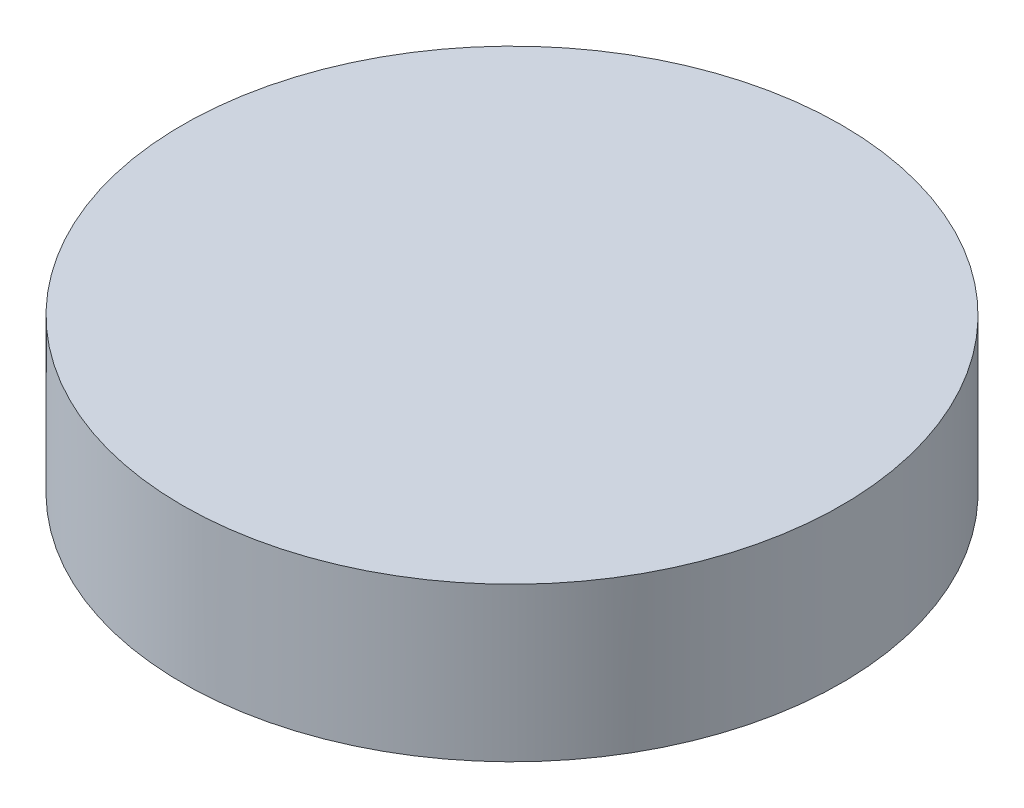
from build123d import *

# Parameters (mm, degrees)
SKETCH1_R           = 15
BOSS_EXTRUDE1_DEPTH = 5
BOSS_EXTRUDE2_START = 2
SKETCH5_R           = 15
SKETCH5_R_2         = 13
SKETCH5_R_3         = 0.805336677
SKETCH5_R_4         = 0.640825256
BOSS_EXTRUDE2_DEPTH = 2
BOSS_EXTRUDE3_DEPTH = 2


with BuildPart() as part:
    # Sketch1 → Boss-Extrude1 (new body)
    with BuildSketch(Plane(origin=(0, 0, 0), x_dir=(1, 0, 0), z_dir=(0, 1, 0))):
        with Locations(Location((0, 0, 0), (0, 0, 270))):
            Circle(SKETCH1_R)
    extrude(amount=BOSS_EXTRUDE1_DEPTH)

    # Sketch5 → Boss-Extrude2 (add)
    # profile 1 of 6: a face of its own
    with BuildSketch(Plane.XZ.offset(BOSS_EXTRUDE2_START)):
        with Locations(Location((0, 0, 0), (0, 0, 270))):
            Circle(SKETCH5_R)
        with Locations(Location((0, 0, 0), (0, 0, 270))):
            Circle(SKETCH5_R_2, mode=Mode.SUBTRACT)
    # profile 2 of 6: a face of its own
    with BuildSketch(Plane.XZ.offset(BOSS_EXTRUDE2_START)):
        with BuildLine():
            ThreePointArc((6.197066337, -6.616619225), (6.703380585, -6.246578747), (6.333340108, -5.740264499))
            Line((6.333340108, -5.740264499), (-7.136846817, -3.645641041))
            ThreePointArc((-7.136846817, -3.645641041), (-7.643161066, -4.015681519), (-7.273120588, -4.521995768))
            Line((-7.273120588, -4.521995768), (6.197066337, -6.616619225))
        make_face()
    # profile 3 of 6: a face of its own
    with BuildSketch(Plane.XZ.offset(BOSS_EXTRUDE2_START)):
        with BuildLine():
            Line((1.921350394, -4.083818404), (4.226253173, -2.278945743))
            Line((4.226253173, -2.278945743), (4.676391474, -3.447725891))
            ThreePointArc((4.676391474, -3.447725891), (5.187318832, -3.674527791), (5.414120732, -3.163600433))
            Line((5.414120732, -3.163600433), (4.877118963, -1.769280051))
            Line((4.877118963, -1.769280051), (8.650736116, 1.185681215))
            ThreePointArc((8.650736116, 1.185681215), (8.733798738, 1.868377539), (8.051102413, 1.951440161))
            Line((8.051102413, 1.951440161), (4.511594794, -0.820199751))
            Line((4.511594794, -0.820199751), (3.854509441, 0.885916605))
            ThreePointArc((3.854509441, 0.885916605), (4.917607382, 1.885265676), (5.119030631, 3.330362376))
            ThreePointArc((5.119030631, 3.330362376), (4.586474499, 3.683084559), (4.233752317, 3.150528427))
            ThreePointArc((4.233752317, 3.150528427), (4.125058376, 2.319690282), (3.529204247, 1.730568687))
            Line((3.529204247, 1.730568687), (3.170992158, 2.660663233))
            ThreePointArc((3.170992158, 2.660663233), (2.6600648, 2.887465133), (2.433262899, 2.376537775))
            Line((2.433262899, 2.376537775), (3.860729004, -1.329865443))
            Line((3.860729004, -1.329865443), (1.321716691, -3.318059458))
            ThreePointArc((1.321716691, -3.318059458), (1.238654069, -4.000755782), (1.921350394, -4.083818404))
        make_face()
    # profile 4 of 6: a face of its own
    with BuildSketch(Plane.XZ.offset(BOSS_EXTRUDE2_START)):
        with BuildLine():
            Line((-0.875721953, -1.166670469), (-0.721055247, -0.228003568))
            Line((-0.721055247, -0.228003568), (0.4885883, -0.427319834))
            ThreePointArc((0.4885883, -0.427319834), (0.986318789, -0.070410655), (0.629409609, 0.427319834))
            Line((0.629409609, 0.427319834), (-0.580233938, 0.626636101))
            Line((-0.580233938, 0.626636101), (-0.53216555, 0.918361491))
            ThreePointArc((-0.53216555, 0.918361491), (-0.935547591, 1.480901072), (-1.498087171, 1.077519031))
            Line((-1.498087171, 1.077519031), (-1.546155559, 0.785793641))
            Line((-1.546155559, 0.785793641), (-2.369733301, 0.921496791))
            add(Edge.make_bspline(
                [(-2.369733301, 0.921496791), (-2.377261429, 1.017453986), (-2.436559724, 1.508344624), (-2.651397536, 2.213498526), (-3.071767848, 3.030069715), (-3.515777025, 3.423670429), (-4.027697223, 3.473710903), (-4.490678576, 3.344985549), (-5.009636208, 2.994804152), (-5.364096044, 2.317409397), (-5.351765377, 1.780167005), (-5.324172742, 1.49650236), (-5.313820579, 1.406602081)],
                knots=[0.359768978, 0.359768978, 0.359768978, 0.359768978, 0.375, 0.4375, 0.46875, 0.5, 0.515625, 0.53125, 0.5625, 0.59375, 0.625, 0.640107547, 0.640107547, 0.640107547, 0.640107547], degree=3))
            Line((-5.313820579, 1.406602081), (-6.296741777, 1.568560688))
            ThreePointArc((-6.296741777, 1.568560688), (-6.794472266, 1.211651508), (-6.437563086, 0.713921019))
            Line((-6.437563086, 0.713921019), (-5.187578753, 0.507957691))
            add(Edge.make_bspline(
                [(-5.187578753, 0.507957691), (-5.147341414, 0.193740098), (-5.122576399, -0.122293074), (-5.136979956, -0.464531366)],
                knots=[0.693045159, 0.693045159, 0.693045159, 0.693045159, 0.749635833, 0.749635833, 0.749635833, 0.749635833], degree=3))
            Line((-5.136979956, -0.464531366), (-6.847685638, -0.182653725))
            ThreePointArc((-6.847685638, -0.182653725), (-7.345416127, -0.539562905), (-6.988506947, -1.037293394))
            Line((-6.988506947, -1.037293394), (-5.249040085, -1.323910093))
            add(Edge.make_bspline(
                [(-5.249040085, -1.323910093), (-5.271173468, -1.424056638), (-5.343954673, -1.707265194), (-5.504797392, -2.123214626), (-5.747498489, -2.482279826), (-5.99677095, -2.651736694), (-6.243898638, -2.683504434), (-6.580111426, -2.549595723), (-6.912164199, -2.289270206), (-7.115417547, -2.08102016), (-7.204983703, -1.979766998)],
                knots=[0.795978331, 0.795978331, 0.795978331, 0.795978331, 0.8125, 0.84375, 0.875, 0.90625, 0.9375, 0.96875, 0.984375, 1, 1, 1, 1], degree=3))
            ThreePointArc((-7.204983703, -1.979766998), (-7.628454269, -1.953830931), (-7.654390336, -2.377301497))
            add(Edge.make_bspline(
                [(-4.656359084, -1.421567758), (-4.683160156, -1.545818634), (-4.821904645, -2.093050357), (-5.1308256, -2.765237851), (-5.753598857, -3.236562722), (-6.375615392, -3.299736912), (-6.900944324, -3.062695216), (-7.320072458, -2.731189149), (-7.550482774, -2.494767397), (-7.654390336, -2.377301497)],
                knots=[0.794442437, 0.794442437, 0.794442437, 0.794442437, 0.8125, 0.875, 0.90625, 0.9375, 0.96875, 0.984375, 1, 1, 1, 1], degree=3))
            Line((-4.656359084, -1.421567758), (-3.887641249, -1.548231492))
            add(Edge.make_bspline(
                [(-1.723356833, -3.420796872), (-1.800278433, -3.471376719), (-2.098637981, -3.615537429), (-2.675605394, -3.680931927), (-3.38657736, -3.534960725), (-3.998248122, -3.214544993), (-4.283801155, -2.566329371), (-4.129240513, -2.021235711), (-3.965224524, -1.689891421), (-3.887641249, -1.548231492)],
                knots=[0.01945361, 0.01945361, 0.01945361, 0.01945361, 0.03125, 0.0625, 0.09375, 0.125, 0.15625, 0.1875, 0.211021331, 0.211021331, 0.211021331, 0.211021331], degree=3))
            ThreePointArc((-1.723356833, -3.420796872), (-1.370034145, -3.32702374), (-1.180213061, -3.014616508))
            Line((-1.180213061, -3.014616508), (-1.016543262, -2.021310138))
            Line((-1.016543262, -2.021310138), (-0.06235556, -2.178534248))
            ThreePointArc((-0.06235556, -2.178534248), (0.435374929, -1.821625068), (0.078465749, -1.323894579))
            Line((0.078465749, -1.323894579), (-0.875721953, -1.166670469))
        make_face()
        with BuildLine():
            Line((-3.412894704, -0.748613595), (-4.540965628, -0.562738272))
            add(Edge.make_bspline(
                [(-4.571959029, 0.40652035), (-4.541833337, 0.122351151), (-4.52347794, -0.200698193), (-4.53980986, -0.541385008), (-4.540965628, -0.562738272)],
                knots=[0.703071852, 0.703071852, 0.703071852, 0.703071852, 0.75, 0.753128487, 0.753128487, 0.753128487, 0.753128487], degree=3))
            Line((-4.571959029, 0.40652035), (-3.019796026, 0.150766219))
            add(Edge.make_bspline(
                [(-3.412894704, -0.748613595), (-3.326522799, -0.600753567), (-3.15395044, -0.285273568), (-3.056218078, -0.001558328), (-3.019796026, 0.150766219)],
                knots=[0.255756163, 0.255756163, 0.255756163, 0.255756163, 0.28125, 0.311624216, 0.311624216, 0.311624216, 0.311624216], degree=3))
        make_face(mode=Mode.SUBTRACT)
        with BuildLine():
            Line((-3.256316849, -1.652256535), (-1.982464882, -1.862152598))
            Line((-1.982464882, -1.862152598), (-2.146134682, -2.855458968))
            ThreePointArc((-2.146134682, -2.855458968), (-2.152158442, -2.913174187), (-2.151309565, -2.971196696))
            add(Edge.make_bspline(
                [(-2.151309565, -2.971196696), (-2.159595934, -2.974382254), (-2.28833046, -3.0212003), (-2.640678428, -3.074543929), (-3.193624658, -2.964789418), (-3.573162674, -2.718925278), (-3.628009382, -2.57690179), (-3.569540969, -2.218966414), (-3.38271577, -1.867713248), (-3.267690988, -1.671522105), (-3.256316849, -1.652256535)],
                knots=[0.029037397, 0.029037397, 0.029037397, 0.029037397, 0.03125, 0.0625, 0.09375, 0.125, 0.15625, 0.1875, 0.21875, 0.222132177, 0.222132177, 0.222132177, 0.222132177], degree=3))
        make_face(mode=Mode.SUBTRACT)
        with BuildLine():
            Line((-2.426587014, 0.053021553), (-1.686976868, -0.068846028))
            Line((-1.686976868, -0.068846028), (-1.841643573, -1.007512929))
            Line((-1.841643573, -1.007512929), (-2.782165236, -0.852540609))
            add(Edge.make_bspline(
                [(-2.782165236, -0.852540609), (-2.731173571, -0.759105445), (-2.581580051, -0.466902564), (-2.475607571, -0.162241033), (-2.428461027, 0.04461869), (-2.426587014, 0.053021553)],
                knots=[0.266365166, 0.266365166, 0.266365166, 0.266365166, 0.28125, 0.3125, 0.313823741, 0.313823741, 0.313823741, 0.313823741], degree=3))
        make_face(mode=Mode.SUBTRACT)
        with BuildLine():
            add(Edge.make_bspline(
                [(-2.982354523, 1.022440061), (-2.986422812, 1.052186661), (-3.015924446, 1.245586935), (-3.107846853, 1.617386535), (-3.309555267, 2.192409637), (-3.580399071, 2.685218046), (-3.801540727, 2.8478461), (-3.954389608, 2.86295541), (-4.209113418, 2.805153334), (-4.564466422, 2.552093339), (-4.747926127, 2.206135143), (-4.753435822, 1.764277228), (-4.716026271, 1.447487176), (-4.696371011, 1.304863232)],
                knots=[0.369281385, 0.369281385, 0.369281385, 0.369281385, 0.375, 0.40625, 0.4375, 0.46875, 0.5, 0.515625, 0.53125, 0.5625, 0.59375, 0.625, 0.650566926, 0.650566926, 0.650566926, 0.650566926], degree=3))
            Line((-2.982354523, 1.022440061), (-4.696371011, 1.304863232))
        make_face(mode=Mode.SUBTRACT)
    # profile 5 of 6: a face of its own
    with BuildSketch(Plane.XZ.offset(BOSS_EXTRUDE2_START)):
        with Locations(Location((-0.660948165, 2.518600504, 0), (0, 0, 90))):
            Circle(SKETCH5_R_3)
    # profile 6 of 6: a face of its own
    with BuildSketch(Plane.XZ.offset(BOSS_EXTRUDE2_START)):
        with Locations(Location((6.265203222, 2.180621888, 0), (0, 0, 90))):
            Circle(SKETCH5_R_4)
    extrude(amount=-BOSS_EXTRUDE2_DEPTH)

    # Sketch6 → Boss-Extrude3 (add)
    # profile 1 of 25: a face of its own
    with BuildSketch(Plane.XZ):
        Polygon((2.668028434, -9.114387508), (2.039711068, -9.201219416), (0.875112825, -11.676253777), (0.560340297, -9.406620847), (-0.095725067, -9.498395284), (0.383166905, -12.947209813), (1.013317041, -12.859130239), (2.176452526, -10.391796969), (2.490664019, -12.654301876), (3.146920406, -12.563202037), align=None)
    # profile 2 of 25: a face of its own
    with BuildSketch(Plane.XZ):
        Polygon((4.171757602, -8.526991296), (2.394637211, -9.206261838), (2.626056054, -9.812981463), (3.787794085, -9.369116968), (4.01275105, -9.958098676), (2.851013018, -10.401963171), (3.078609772, -10.997050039), (4.240347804, -10.553185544), (4.567650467, -11.409033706), (3.405912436, -11.852898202), (3.638211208, -12.461652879), (5.415331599, -11.782382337), align=None)
    # profile 3 of 25: a face of its own
    with BuildSketch(Plane.XZ):
        Polygon((5.676062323, -7.6185237), (4.058675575, -8.613060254), (4.398053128, -9.165092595), (5.456165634, -8.514906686), (5.785298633, -9.049944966), (4.727186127, -9.700130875), (5.060667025, -10.242093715), (6.118779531, -9.591907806), (6.597886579, -10.370546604), (5.539774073, -11.020732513), (5.880392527, -11.574967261), (7.497779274, -10.580430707), align=None)
    # profile 4 of 25: a face of its own
    with BuildSketch(Plane.XZ):
        Polygon((7.731357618, -5.424538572), (7.28273248, -5.892976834), (8.481795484, -8.15371348), (6.16187011, -7.064042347), (5.719978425, -7.525874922), (7.829993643, -10.358654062), (8.271885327, -9.896821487), (6.941474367, -8.106309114), (9.042872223, -9.091696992), (9.447165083, -8.669377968), (8.364558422, -6.619775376), (10.216781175, -7.865014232), (10.663365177, -7.398067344), align=None)
    # profile 5 of 25: a face of its own
    with BuildSketch(Plane.XZ):
        Polygon((8.560917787, -3.927979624), (8.260207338, -4.525018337), (10.75494135, -7.272120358), (11.062875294, -6.660112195), (10.547583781, -6.097852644), (11.182563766, -4.836067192), (11.946747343, -4.904385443), (12.254681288, -4.29237728), align=None)
        Polygon((9.229021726, -4.643119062), (10.498317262, -4.766029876), (10.08420501, -5.58786652), align=None, mode=Mode.SUBTRACT)
    # profile 6 of 25: a face of its own
    with BuildSketch(Plane.XZ):
        Polygon((9.512339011, -0.743014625), (9.357826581, -1.435119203), (10.431807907, -2.337383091), (9.077135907, -2.69163212), (8.924602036, -3.37459421), (11.064141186, -2.814794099), (12.52940119, -3.142596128), (12.674580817, -2.493367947), (11.209320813, -2.165565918), align=None)
    # profile 7 of 25: a face of its own
    with BuildSketch(Plane.XZ):
        Polygon((9.163097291, 2.522817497), (9.240000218, 1.894585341), (11.690688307, 0.693262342), (9.421127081, 0.415161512), (9.501402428, -0.241131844), (12.950386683, 0.180990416), (12.87297569, 0.811263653), (10.429768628, 2.011558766), (12.692356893, 2.288646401), (12.612081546, 2.944939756), align=None)
    # profile 8 of 25: a face of its own
    with BuildSketch(Plane.XZ):
        Polygon((8.556243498, 3.881251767), (8.811738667, 3.257907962), (12.546284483, 3.343246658), (12.283911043, 3.980503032), (11.516358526, 3.959165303), (10.975930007, 5.27440194), (11.53212011, 5.810806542), (11.269751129, 6.449054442), align=None)
        Polygon((9.541007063, 3.916486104), (10.471086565, 4.800729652), (10.823201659, 3.944433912), align=None, mode=Mode.SUBTRACT)
    # profile 9 of 25: a face of its own
    with BuildSketch(Plane.XZ):
        Polygon((6.739851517, 6.69282055), (7.145094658, 6.157329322), (8.191891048, 6.94912036), (8.893876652, 6.020766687), (7.847080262, 5.228975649), (8.251352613, 4.695213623), (11.02652381, 6.794481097), (10.622251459, 7.328243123), (9.406046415, 6.407799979), (8.704060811, 7.336153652), (9.920265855, 8.256596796), (9.515022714, 8.792088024), align=None)
    # profile 10 of 25: a face of its own
    with BuildSketch(Plane.XZ):
        Polygon((5.120084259, 7.976198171), (5.640368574, 7.549124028), (6.403658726, 8.479254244), (6.37451538, 6.946794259), (6.993960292, 6.438758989), (7.038930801, 8.42057756), (9.304637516, 9.068141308), (8.694544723, 9.568754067), (6.874306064, 9.053313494), (7.859449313, 10.25383199), (7.339164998, 10.680906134), align=None)
    # profile 11 of 25: a face of its own
    with BuildSketch(Plane.XZ):
        Polygon((2.128692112, 9.263823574), (2.756435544, 9.029111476), (3.21545251, 10.256512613), (4.303413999, 9.849602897), (3.844397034, 8.62220176), (4.471080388, 8.388407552), (5.687116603, 11.641516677), (5.060433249, 11.875310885), (4.527259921, 10.448730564), (3.439298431, 10.85564028), (3.972471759, 12.2822206), (3.344728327, 12.516932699), align=None)
    # profile 12 of 25: a face of its own
    with BuildSketch(Plane.XZ):
        Polygon((0.612158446, 9.396669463), (1.277550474, 9.329633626), (2.951549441, 12.646105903), (2.269249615, 12.714443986), (1.928103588, 12.031263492), (0.521444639, 12.172225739), (0.311417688, 12.910592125), (-0.370742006, 12.979617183), align=None)
        Polygon((1.041511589, 10.277240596), (0.700677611, 11.50740347), (1.617191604, 11.415618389), align=None, mode=Mode.SUBTRACT)
    # profile 13 of 25: a face of its own
    with BuildSketch(Plane.XZ):
        Polygon((-1.735541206, 9.349733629), (-1.079414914, 9.424445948), (-1.401207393, 12.24653088), (-0.445059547, 12.355415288), (-0.516460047, 12.981371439), (-2.128734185, 12.797774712), align=None)
    # profile 14 of 25: a face of its own
    with BuildSketch(Plane.XZ):
        Polygon((-3.185157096, 8.951582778), (-2.54688667, 9.128066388), (-3.307509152, 11.871582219), (-2.378056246, 12.129740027), (-2.546588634, 12.738435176), (-4.114311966, 12.303793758), align=None)
    # profile 15 of 25: a face of its own
    with BuildSketch(Plane.XZ):
        with BuildLine():
            Line((-5.262591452, 7.889636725), (-4.665230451, 8.189005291))
            Line((-4.665230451, 8.189005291), (-5.679870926, 10.211681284))
            add(Edge.make_bspline(
                [(-5.679870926, 10.211681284), (-5.690206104, 10.232691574), (-5.710190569, 10.273317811), (-5.737200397, 10.332535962), (-5.760389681, 10.387818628), (-5.780022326, 10.438875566), (-5.795324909, 10.486188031), (-5.807267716, 10.529408), (-5.81574593, 10.568345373), (-5.821092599, 10.614502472), (-5.820199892, 10.66901351), (-5.810171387, 10.732831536), (-5.788199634, 10.79475564), (-5.756732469, 10.854367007), (-5.715565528, 10.910624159), (-5.664679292, 10.961967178), (-5.603977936, 11.007554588), (-5.558486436, 11.032368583), (-5.53502637, 11.045165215)],
                knots=[0, 0, 0, 0, 1.151651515, 2.22687398, 3.200788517, 4.100068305, 4.916556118, 5.645486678, 6.305138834, 6.87435779, 7.927414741, 8.976259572, 10.037815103, 11.143394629, 12.28148427, 13.45360715, 14.686819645, 16, 16, 16, 16], degree=3))
            add(Edge.make_bspline(
                [(-5.53502637, 11.045165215), (-5.50920084, 11.057032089), (-5.458958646, 11.080118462), (-5.380714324, 11.101605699), (-5.303545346, 11.112949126), (-5.22817542, 11.111117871), (-5.156368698, 11.099082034), (-5.090102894, 11.077054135), (-5.029988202, 11.045587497), (-4.984440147, 11.011173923), (-4.950446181, 10.976233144), (-4.923179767, 10.942920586), (-4.893105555, 10.903609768), (-4.863539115, 10.855565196), (-4.829614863, 10.802186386), (-4.795263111, 10.740865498), (-4.758061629, 10.673119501), (-4.733830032, 10.625033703), (-4.721176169, 10.599923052)],
                knots=[0, 0, 0, 0, 1.268488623, 2.467777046, 3.612697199, 4.743230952, 5.82240804, 6.856349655, 7.850695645, 8.843119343, 9.392701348, 10.026127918, 10.766541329, 11.602807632, 12.545554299, 13.593490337, 14.743308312, 16, 16, 16, 16], degree=3))
            Line((-4.721176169, 10.599923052), (-3.743833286, 8.651496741))
            Line((-3.743833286, 8.651496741), (-3.146472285, 8.950865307))
            Line((-3.146472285, 8.950865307), (-4.080887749, 10.813834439))
            add(Edge.make_bspline(
                [(-4.080887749, 10.813834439), (-4.099875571, 10.851550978), (-4.136399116, 10.924099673), (-4.191355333, 11.027168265), (-4.243618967, 11.120577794), (-4.292201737, 11.204333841), (-4.338703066, 11.277852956), (-4.38195157, 11.341518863), (-4.421317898, 11.396522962), (-4.472282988, 11.45551927), (-4.539870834, 11.519096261), (-4.629744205, 11.586314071), (-4.731262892, 11.644690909), (-4.841666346, 11.694959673), (-4.957802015, 11.735686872), (-5.076537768, 11.762064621), (-5.195327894, 11.774842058), (-5.314707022, 11.773913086), (-5.435586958, 11.757937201), (-5.558791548, 11.728520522), (-5.684226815, 11.683810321), (-5.766513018, 11.645099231), (-5.808841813, 11.625185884)],
                knots=[0, 0, 0, 0, 1.153056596, 2.217932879, 3.189259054, 4.075858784, 4.861660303, 5.564015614, 6.177739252, 6.707281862, 7.690444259, 8.705163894, 9.76513324, 10.881689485, 12.01394803, 13.119414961, 14.19530681, 15.270043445, 16.3712838, 17.517698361, 18.723080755, 20, 20, 20, 20], degree=3))
            add(Edge.make_bspline(
                [(-5.808841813, 11.625185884), (-5.836412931, 11.610659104), (-5.890902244, 11.58194956), (-5.968625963, 11.534426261), (-6.04053794, 11.482339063), (-6.108056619, 11.428088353), (-6.169222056, 11.368872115), (-6.226360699, 11.307546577), (-6.27685536, 11.241371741), (-6.323002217, 11.173184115), (-6.362877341, 11.102573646), (-6.39893609, 11.032134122), (-6.427243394, 10.960327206), (-6.451477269, 10.888903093), (-6.468821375, 10.817017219), (-6.481725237, 10.74525819), (-6.486659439, 10.6730694), (-6.487895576, 10.599221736), (-6.480715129, 10.521085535), (-6.465881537, 10.435917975), (-6.440709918, 10.342897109), (-6.410134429, 10.24039427), (-6.368018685, 10.130510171), (-6.319574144, 10.011566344), (-6.261722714, 9.884594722), (-6.219141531, 9.797749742), (-6.197006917, 9.752605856)],
                knots=[0, 0, 0, 0, 1.020265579, 2.016369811, 2.979569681, 3.926089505, 4.849467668, 5.764692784, 6.667777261, 7.571898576, 8.458393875, 9.321461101, 10.160411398, 10.983151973, 11.788993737, 12.579539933, 13.367154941, 14.155364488, 14.995465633, 15.93194112, 16.982407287, 18.148677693, 19.432827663, 20.83308917, 22.353771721, 24, 24, 24, 24], degree=3))
            Line((-6.197006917, 9.752605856), (-5.262591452, 7.889636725))
        make_face()
    # profile 16 of 25: a face of its own
    with BuildSketch(Plane.XZ):
        with BuildLine():
            Line((-7.660117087, 5.589360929), (-7.112610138, 6.156635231))
            add(Edge.make_bspline(
                [(-7.112610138, 6.156635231), (-7.070122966, 6.201301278), (-6.987972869, 6.287664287), (-6.874561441, 6.418029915), (-6.774457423, 6.543763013), (-6.68592876, 6.664076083), (-6.610957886, 6.780316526), (-6.547213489, 6.891368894), (-6.497475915, 6.998287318), (-6.460118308, 7.101801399), (-6.434118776, 7.204153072), (-6.416029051, 7.307287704), (-6.405536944, 7.412465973), (-6.403768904, 7.519988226), (-6.410744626, 7.629697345), (-6.42530709, 7.741666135), (-6.447681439, 7.855733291), (-6.478276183, 7.971180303), (-6.517402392, 8.086792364), (-6.564800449, 8.200778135), (-6.621063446, 8.312483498), (-6.685956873, 8.421330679), (-6.759000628, 8.528055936), (-6.839875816, 8.632772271), (-6.929842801, 8.734726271), (-6.994752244, 8.799692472), (-7.027614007, 8.832582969)],
                knots=[0, 0, 0, 0, 1.445079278, 2.794099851, 4.049206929, 5.212110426, 6.294294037, 7.290346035, 8.211654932, 9.055090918, 9.866417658, 10.684175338, 11.507858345, 12.341809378, 13.202281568, 14.082755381, 14.987111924, 15.9254828, 16.8805952, 17.846334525, 18.817158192, 19.810191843, 20.814930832, 21.847372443, 22.910187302, 24, 24, 24, 24], degree=3))
            add(Edge.make_bspline(
                [(-7.027614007, 8.832582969), (-7.076341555, 8.877328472), (-7.172004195, 8.965173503), (-7.326416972, 9.07972699), (-7.487129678, 9.175412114), (-7.652072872, 9.253857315), (-7.819469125, 9.313370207), (-7.986788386, 9.353185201), (-8.152338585, 9.375597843), (-8.315380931, 9.377172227), (-8.472764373, 9.361659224), (-8.622773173, 9.331809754), (-8.76331561, 9.284638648), (-8.875615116, 9.233105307), (-8.964542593, 9.178705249), (-9.038536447, 9.127894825), (-9.117974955, 9.064242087), (-9.20625841, 8.992441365), (-9.299957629, 8.90760183), (-9.400623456, 8.812281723), (-9.50891667, 8.706724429), (-9.581850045, 8.631401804), (-9.619798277, 8.592210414)],
                knots=[0, 0, 0, 0, 1.321618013, 2.594619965, 3.834592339, 5.054687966, 6.239590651, 7.378531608, 8.486661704, 9.57158961, 10.629296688, 11.642971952, 12.621489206, 13.586296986, 14.104880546, 14.703537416, 15.379066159, 16.138644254, 16.977752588, 17.904505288, 18.909685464, 20, 20, 20, 20], degree=3))
            Line((-9.619798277, 8.592210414), (-10.175416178, 8.016230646))
            Line((-10.175416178, 8.016230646), (-7.660117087, 5.589360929))
        make_face()
        with BuildLine():
            Line((-7.661886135, 6.512551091), (-9.246737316, 8.04134521))
            Line((-9.246737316, 8.04134521), (-9.032200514, 8.263607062))
            add(Edge.make_bspline(
                [(-9.032200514, 8.263607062), (-9.00631303, 8.289635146), (-8.956378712, 8.339840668), (-8.882751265, 8.4110197), (-8.811089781, 8.473363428), (-8.742328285, 8.527466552), (-8.677191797, 8.574668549), (-8.614765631, 8.613400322), (-8.555478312, 8.644640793), (-8.480636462, 8.675749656), (-8.384573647, 8.69871126), (-8.264572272, 8.707973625), (-8.13849506, 8.696626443), (-8.007368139, 8.667370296), (-7.873049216, 8.618104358), (-7.739913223, 8.544803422), (-7.606961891, 8.451557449), (-7.524827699, 8.375888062), (-7.482230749, 8.336643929)],
                knots=[0, 0, 0, 0, 0.980241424, 1.890785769, 2.733819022, 3.515167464, 4.226519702, 4.880573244, 5.475117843, 6.014146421, 7.041011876, 8.09654581, 9.21504285, 10.407745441, 11.675532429, 13.020873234, 14.454946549, 16, 16, 16, 16], degree=3))
            add(Edge.make_bspline(
                [(-7.482230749, 8.336643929), (-7.450363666, 8.304828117), (-7.388280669, 8.242845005), (-7.306695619, 8.143487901), (-7.237406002, 8.042389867), (-7.180088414, 7.939810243), (-7.135197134, 7.835639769), (-7.103312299, 7.729683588), (-7.082456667, 7.62218568), (-7.079341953, 7.549532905), (-7.07778774, 7.513279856)],
                knots=[0, 0, 0, 0, 1.146160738, 2.232934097, 3.268164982, 4.263610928, 5.220727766, 6.150380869, 7.077057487, 8, 8, 8, 8], degree=3))
            add(Edge.make_bspline(
                [(-7.07778774, 7.513279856), (-7.078709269, 7.480147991), (-7.080579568, 7.412904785), (-7.101465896, 7.311508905), (-7.135721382, 7.209083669), (-7.181934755, 7.104417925), (-7.242950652, 6.998796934), (-7.317611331, 6.89176994), (-7.405089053, 6.782417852), (-7.470853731, 6.711789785), (-7.504876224, 6.675251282)],
                knots=[0, 0, 0, 0, 0.824035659, 1.672432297, 2.565404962, 3.510198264, 4.51632288, 5.597599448, 6.757149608, 8, 8, 8, 8], degree=3))
            Line((-7.504876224, 6.675251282), (-7.661886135, 6.512551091))
        make_face(mode=Mode.SUBTRACT)
    # profile 17 of 25: a face of its own
    with BuildSketch(Plane.XZ):
        Polygon((-8.39567108, 4.268126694), (-8.071672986, 4.853206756), (-10.45444318, 7.698239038), (-10.78624931, 7.0991896), (-10.294078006, 6.516295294), (-10.979626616, 5.280523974), (-11.740246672, 5.379988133), (-12.072647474, 4.780567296), align=None)
        Polygon((-9.034644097, 5.010631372), (-10.297932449, 5.183017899), (-9.851831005, 5.988190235), align=None, mode=Mode.SUBTRACT)
    # profile 18 of 25: a face of its own
    with BuildSketch(Plane.XZ):
        Polygon((-9.208143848, 1.889375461), (-9.050083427, 2.542916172), (-12.118345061, 4.664851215), (-12.280665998, 3.995367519), (-11.647857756, 3.562543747), (-11.982073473, 2.181981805), (-12.745914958, 2.075093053), (-12.908235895, 1.405609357), align=None)
        Polygon((-10.025557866, 2.438470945), (-11.296226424, 2.269075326), (-11.07856805, 3.168709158), align=None, mode=Mode.SUBTRACT)
    # profile 19 of 25: a face of its own
    with BuildSketch(Plane.XZ):
        Polygon((-9.228937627, -1.987150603), (-9.268351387, -1.338664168), (-11.745248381, -0.681354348), (-9.366495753, 0.282245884), (-9.40542962, 0.920903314), (-12.922404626, 1.295924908), (-12.883470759, 0.657267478), (-10.662469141, 0.417520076), (-12.815345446, -0.45738272), (-12.780179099, -1.041410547), (-10.53791697, -1.638758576), (-12.712305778, -2.15397253), (-12.673228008, -2.799674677), align=None)
    # profile 20 of 25: a face of its own
    with BuildSketch(Plane.XZ):
        Polygon((-9.065967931, -2.86464747), (-9.241761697, -2.230390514), (-12.595063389, -3.161941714), (-12.419269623, -3.79619867), align=None)
    # profile 21 of 25: a face of its own
    with BuildSketch(Plane.XZ):
        with BuildLine():
            add(Edge.make_bspline(
                [(-11.009569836, -5.493637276), (-11.021734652, -5.471856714), (-11.045628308, -5.429076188), (-11.096087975, -5.375740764), (-11.15588579, -5.333480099), (-11.223902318, -5.304032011), (-11.295577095, -5.285755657), (-11.368602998, -5.28336034), (-11.44065971, -5.295801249), (-11.485482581, -5.315326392), (-11.50826024, -5.325248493)],
                knots=[0, 0, 0, 0, 1.020372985, 2.004176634, 2.982731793, 4.006254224, 5.028697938, 5.999706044, 6.983509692, 8, 8, 8, 8], degree=3))
            add(Edge.make_bspline(
                [(-11.50826024, -5.325248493), (-11.530041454, -5.337412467), (-11.572823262, -5.361304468), (-11.626320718, -5.411938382), (-11.66869841, -5.471927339), (-11.698479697, -5.540171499), (-11.716070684, -5.61233282), (-11.717520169, -5.685335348), (-11.706152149, -5.757739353), (-11.6861756, -5.802451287), (-11.675948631, -5.825341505)],
                knots=[0, 0, 0, 0, 1.017816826, 1.999155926, 2.984821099, 4.005779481, 5.029467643, 6.003553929, 6.977921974, 8, 8, 8, 8], degree=3))
            add(Edge.make_bspline(
                [(-11.675948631, -5.825341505), (-11.663783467, -5.847120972), (-11.639889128, -5.889899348), (-11.589434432, -5.943250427), (-11.529617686, -5.985451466), (-11.461589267, -6.015169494), (-11.38922402, -6.032661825), (-11.315925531, -6.034580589), (-11.243017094, -6.023852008), (-11.198175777, -6.003722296), (-11.17529494, -5.993450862)],
                knots=[0, 0, 0, 0, 1.017200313, 1.997944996, 2.973457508, 3.993797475, 5.016865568, 5.998169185, 6.978541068, 8, 8, 8, 8], degree=3))
            add(Edge.make_bspline(
                [(-11.17529494, -5.993450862), (-11.153452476, -5.981349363), (-11.110585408, -5.95759949), (-11.058154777, -5.906275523), (-11.015552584, -5.847007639), (-10.987214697, -5.77872816), (-10.969994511, -5.706813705), (-10.967831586, -5.633834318), (-10.979402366, -5.561239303), (-10.999355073, -5.516527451), (-11.009569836, -5.493637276)],
                knots=[0, 0, 0, 0, 1.02027048, 2.002338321, 2.980795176, 3.997092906, 5.014475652, 5.998741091, 6.975458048, 8, 8, 8, 8], degree=3))
        make_face()
    # profile 22 of 25: a face of its own
    with BuildSketch(Plane.XZ):
        with BuildLine():
            Line((-7.149844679, -6.252576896), (-7.555633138, -5.680142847))
            add(Edge.make_bspline(
                [(-7.555633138, -5.680142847), (-7.582547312, -5.642399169), (-7.634378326, -5.56971282), (-7.713151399, -5.467889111), (-7.787848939, -5.37608084), (-7.858537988, -5.293886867), (-7.927216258, -5.223153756), (-7.991924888, -5.162100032), (-8.053016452, -5.111052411), (-8.129645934, -5.057103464), (-8.228271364, -5.006728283), (-8.352476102, -4.96486518), (-8.484008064, -4.943738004), (-8.597395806, -4.943229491), (-8.689856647, -4.95149176), (-8.759451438, -4.964327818), (-8.828647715, -4.982095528), (-8.897686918, -5.004240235), (-8.965594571, -5.033673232), (-9.033710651, -5.067021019), (-9.100844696, -5.106592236), (-9.144542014, -5.136103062), (-9.166662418, -5.151041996)],
                knots=[0, 0, 0, 0, 1.424561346, 2.743404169, 3.955522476, 5.061998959, 6.073812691, 6.983950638, 7.795190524, 8.518378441, 9.860197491, 11.181951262, 12.531686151, 13.935380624, 14.65524385, 15.382202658, 16.107314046, 16.850033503, 17.607607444, 18.379649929, 19.179748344, 20, 20, 20, 20], degree=3))
            add(Edge.make_bspline(
                [(-9.166662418, -5.151041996), (-9.189226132, -5.167646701), (-9.23346616, -5.200203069), (-9.294342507, -5.253625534), (-9.350524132, -5.307859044), (-9.399502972, -5.365534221), (-9.443859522, -5.424484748), (-9.481719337, -5.486077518), (-9.514025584, -5.549779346), (-9.540239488, -5.615697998), (-9.56020118, -5.68395959), (-9.575645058, -5.754014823), (-9.583584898, -5.826697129), (-9.586028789, -5.901278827), (-9.583324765, -5.97825286), (-9.573242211, -6.057219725), (-9.55972056, -6.139023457), (-9.544856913, -6.193340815), (-9.537289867, -6.220993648)],
                knots=[0, 0, 0, 0, 1.10171746, 2.160105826, 3.18406316, 4.171020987, 5.133693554, 6.084168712, 7.011409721, 7.940836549, 8.870672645, 9.807032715, 10.759507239, 11.742473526, 12.741352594, 13.785870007, 14.872791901, 16, 16, 16, 16], degree=3))
            Line((-9.537289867, -6.220993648), (-11.273044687, -6.443303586))
            Line((-11.273044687, -6.443303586), (-10.854912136, -7.033461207))
            Line((-10.854912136, -7.033461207), (-9.202687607, -6.820402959))
            Line((-9.202687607, -6.820402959), (-9.166941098, -6.870891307))
            Line((-9.166941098, -6.870891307), (-10.36723369, -7.72168039))
            Line((-10.36723369, -7.72168039), (-9.984847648, -8.261349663))
            Line((-9.984847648, -8.261349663), (-7.149844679, -6.252576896))
        make_face()
        with BuildLine():
            Line((-8.640292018, -6.498045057), (-8.760536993, -6.328623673))
            add(Edge.make_bspline(
                [(-8.760536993, -6.328623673), (-8.775182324, -6.307826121), (-8.803238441, -6.267984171), (-8.840255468, -6.208460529), (-8.872691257, -6.153026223), (-8.897117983, -6.099955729), (-8.919262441, -6.051870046), (-8.93356021, -6.006335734), (-8.943279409, -5.964460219), (-8.947097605, -5.913779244), (-8.939673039, -5.852751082), (-8.908508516, -5.78465895), (-8.858405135, -5.721419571), (-8.814221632, -5.687226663), (-8.790790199, -5.669093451)],
                knots=[0, 0, 0, 0, 1.203804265, 2.306132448, 3.317733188, 4.240829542, 5.070641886, 5.820738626, 6.496227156, 7.100564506, 8.220189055, 9.363128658, 10.601612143, 12, 12, 12, 12], degree=3))
            add(Edge.make_bspline(
                [(-8.790790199, -5.669093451), (-8.77555665, -5.658911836), (-8.745851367, -5.639057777), (-8.696860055, -5.618747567), (-8.646849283, -5.606382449), (-8.59588397, -5.601732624), (-8.545233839, -5.605619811), (-8.496028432, -5.616813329), (-8.449108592, -5.635806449), (-8.411367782, -5.657572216), (-8.381597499, -5.681040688), (-8.356763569, -5.703340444), (-8.329269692, -5.73018614), (-8.300532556, -5.762642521), (-8.269575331, -5.799733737), (-8.236397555, -5.841383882), (-8.200865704, -5.887684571), (-8.177453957, -5.920998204), (-8.165299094, -5.938293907)],
                knots=[0, 0, 0, 0, 1.127711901, 2.199028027, 3.250379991, 4.295290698, 5.340698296, 6.370489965, 7.394719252, 8.451883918, 9.044392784, 9.729574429, 10.50973736, 11.412703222, 12.401432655, 13.489201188, 14.696448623, 16, 16, 16, 16], degree=3))
            Line((-8.165299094, -5.938293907), (-8.060006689, -6.086843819))
            Line((-8.060006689, -6.086843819), (-8.640292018, -6.498045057))
        make_face(mode=Mode.SUBTRACT)
    # profile 23 of 25: a face of its own
    with BuildSketch(Plane.XZ):
        with BuildLine():
            Line((-7.579464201, -6.595947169), (-7.517331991, -7.250130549))
            add(Edge.make_bspline(
                [(-7.517331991, -7.250130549), (-7.464908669, -7.245178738), (-7.362215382, -7.235478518), (-7.21003389, -7.237678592), (-7.063755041, -7.253902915), (-6.923380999, -7.285517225), (-6.788677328, -7.330209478), (-6.660180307, -7.390087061), (-6.53713418, -7.463306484), (-6.461640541, -7.522722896), (-6.423531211, -7.552716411)],
                knots=[0, 0, 0, 0, 1.080839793, 2.11728263, 3.119539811, 4.09836308, 5.067166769, 6.028605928, 7.004836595, 8, 8, 8, 8], degree=3))
            add(Edge.make_bspline(
                [(-6.423531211, -7.552716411), (-6.391753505, -7.580468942), (-6.329336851, -7.634979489), (-6.246689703, -7.725534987), (-6.175267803, -7.820636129), (-6.113876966, -7.920358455), (-6.063666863, -8.025211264), (-6.024744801, -8.135218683), (-5.996052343, -8.2496057), (-5.979708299, -8.367544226), (-5.972573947, -8.486135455), (-5.978441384, -8.602722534), (-5.993926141, -8.716163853), (-6.022591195, -8.825564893), (-6.061549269, -8.931698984), (-6.111713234, -9.034558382), (-6.174086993, -9.133690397), (-6.222886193, -9.195741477), (-6.247640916, -9.227218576)],
                knots=[0, 0, 0, 0, 1.078023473, 2.117415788, 3.127523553, 4.115093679, 5.10663272, 6.093877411, 7.09391413, 8.116318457, 9.133909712, 10.126834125, 11.096177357, 12.056044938, 13.012185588, 13.982633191, 14.976635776, 16, 16, 16, 16], degree=3))
            add(Edge.make_bspline(
                [(-6.247640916, -9.227218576), (-6.275052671, -9.258240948), (-6.328893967, -9.319174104), (-6.418947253, -9.39969121), (-6.513617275, -9.469995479), (-6.615063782, -9.527973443), (-6.720988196, -9.577018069), (-6.833601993, -9.61303137), (-6.951206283, -9.639462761), (-7.073078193, -9.653805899), (-7.196284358, -9.65827368), (-7.317669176, -9.648770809), (-7.436341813, -9.629980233), (-7.551334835, -9.597114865), (-7.664157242, -9.554071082), (-7.77284813, -9.497204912), (-7.880230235, -9.43132979), (-7.946349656, -9.37797442), (-7.979991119, -9.350827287)],
                knots=[0, 0, 0, 0, 1.025772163, 2.014788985, 2.989301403, 3.944389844, 4.90720072, 5.878399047, 6.87021342, 7.891819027, 8.917116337, 9.922100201, 10.906419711, 11.891353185, 12.882269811, 13.895308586, 14.92913612, 16, 16, 16, 16], degree=3))
            add(Edge.make_bspline(
                [(-7.979991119, -9.350827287), (-8.001093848, -9.332481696), (-8.04270255, -9.2963093), (-8.100654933, -9.239405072), (-8.152656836, -9.180438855), (-8.20005441, -9.121048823), (-8.240713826, -9.059429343), (-8.277579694, -8.997674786), (-8.307148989, -8.933384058), (-8.333031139, -8.868215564), (-8.351996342, -8.800754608), (-8.365818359, -8.731804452), (-8.374513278, -8.660879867), (-8.376296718, -8.587797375), (-8.374697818, -8.51254685), (-8.365977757, -8.435457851), (-8.352454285, -8.356382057), (-8.339459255, -8.303584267), (-8.332827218, -8.27663882)],
                knots=[0, 0, 0, 0, 1.114025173, 2.196547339, 3.233032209, 4.245307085, 5.221073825, 6.172589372, 7.107742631, 8.037315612, 8.963898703, 9.895288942, 10.837463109, 11.806720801, 12.805716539, 13.834138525, 14.894648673, 16, 16, 16, 16], degree=3))
            Line((-8.332827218, -8.27663882), (-7.558732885, -8.924545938))
            Line((-7.558732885, -8.924545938), (-7.158889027, -8.44655181))
            Line((-7.158889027, -8.44655181), (-8.503959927, -7.321495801))
            Line((-8.503959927, -7.321495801), (-8.601801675, -7.430995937))
            add(Edge.make_bspline(
                [(-8.601801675, -7.430995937), (-8.625630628, -7.460496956), (-8.673044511, -7.519196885), (-8.735617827, -7.613093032), (-8.792850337, -7.70966049), (-8.843167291, -7.810205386), (-8.887388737, -7.914324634), (-8.924091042, -8.022570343), (-8.954727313, -8.13408063), (-8.977865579, -8.248373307), (-8.994915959, -8.363113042), (-9.004610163, -8.477126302), (-9.006273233, -8.589355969), (-9.001688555, -8.699817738), (-8.989360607, -8.808305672), (-8.96923716, -8.914872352), (-8.942753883, -9.019861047), (-8.908539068, -9.122755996), (-8.866766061, -9.223292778), (-8.817773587, -9.321383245), (-8.761278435, -9.41689967), (-8.697211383, -9.509735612), (-8.62604839, -9.600234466), (-8.547378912, -9.688311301), (-8.460572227, -9.773097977), (-8.398763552, -9.827012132), (-8.367402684, -9.854367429)],
                knots=[0, 0, 0, 0, 1.004573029, 1.998858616, 2.98710668, 3.978126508, 4.976263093, 5.982743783, 7.005052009, 8.039057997, 9.071281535, 10.077914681, 11.069128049, 12.044087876, 13.006134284, 13.960010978, 14.916297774, 15.873707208, 16.831056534, 17.799284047, 18.777229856, 19.769642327, 20.786532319, 21.826531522, 22.8972121, 24, 24, 24, 24], degree=3))
            add(Edge.make_bspline(
                [(-8.367402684, -9.854367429), (-8.332850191, -9.882500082), (-8.264582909, -9.938083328), (-8.157156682, -10.012722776), (-8.048317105, -10.080404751), (-7.937093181, -10.1393811), (-7.824320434, -10.190833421), (-7.70931816, -10.2335465), (-7.592659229, -10.268980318), (-7.474212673, -10.296115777), (-7.355208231, -10.31547844), (-7.235908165, -10.325122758), (-7.117031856, -10.327678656), (-6.998216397, -10.320868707), (-6.879321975, -10.3071875), (-6.761066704, -10.283135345), (-6.642863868, -10.252175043), (-6.525885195, -10.212342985), (-6.41089361, -10.165759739), (-6.30019359, -10.111305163), (-6.193685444, -10.051140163), (-6.092713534, -9.9830488), (-5.994616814, -9.910452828), (-5.902699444, -9.829160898), (-5.814494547, -9.7423492), (-5.760304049, -9.679737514), (-5.733063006, -9.648263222)],
                knots=[0, 0, 0, 0, 1.085603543, 2.144887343, 3.18555392, 4.207692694, 5.210977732, 6.204448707, 7.195385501, 8.18039483, 9.163970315, 10.131147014, 11.09518213, 12.059553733, 13.029544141, 14.009401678, 14.998027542, 16.005765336, 17.019025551, 18.019720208, 19.010558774, 19.997821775, 20.986185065, 21.982574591, 22.985859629, 24, 24, 24, 24], degree=3))
            add(Edge.make_bspline(
                [(-5.733063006, -9.648263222), (-5.697629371, -9.603690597), (-5.627700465, -9.515725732), (-5.538206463, -9.374959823), (-5.463081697, -9.229691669), (-5.402836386, -9.079293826), (-5.357230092, -8.923840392), (-5.326272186, -8.763683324), (-5.308509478, -8.598786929), (-5.309646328, -8.487373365), (-5.310221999, -8.430956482)],
                knots=[0, 0, 0, 0, 1.03572466, 2.044020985, 3.030001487, 4.008356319, 4.987967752, 5.973718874, 6.973944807, 8, 8, 8, 8], degree=3))
            add(Edge.make_bspline(
                [(-5.310221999, -8.430956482), (-5.31191191, -8.397339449), (-5.315260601, -8.33072465), (-5.325829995, -8.231802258), (-5.34211507, -8.134862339), (-5.362355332, -8.039776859), (-5.388839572, -7.946870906), (-5.418891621, -7.855826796), (-5.45550246, -7.766989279), (-5.495536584, -7.679791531), (-5.541829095, -7.594964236), (-5.59320607, -7.512334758), (-5.649030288, -7.4312649), (-5.709570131, -7.352104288), (-5.775693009, -7.2754437), (-5.846810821, -7.200878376), (-5.922712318, -7.127810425), (-5.976557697, -7.081695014), (-6.003840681, -7.058328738)],
                knots=[0, 0, 0, 0, 1.017537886, 2.016331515, 3.005657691, 3.988452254, 4.95379414, 5.925091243, 6.885455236, 7.857214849, 8.82472651, 9.804875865, 10.797828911, 11.79961728, 12.816345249, 13.856976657, 14.914148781, 16, 16, 16, 16], degree=3))
            add(Edge.make_bspline(
                [(-6.003840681, -7.058328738), (-6.032986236, -7.03456789), (-6.090834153, -6.987407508), (-6.181423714, -6.922618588), (-6.273072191, -6.861947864), (-6.367587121, -6.807464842), (-6.463807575, -6.758098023), (-6.561943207, -6.713287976), (-6.662051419, -6.674395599), (-6.730167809, -6.65250864), (-6.764125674, -6.641597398)],
                knots=[0, 0, 0, 0, 1.033656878, 2.051595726, 3.060653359, 4.054538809, 5.049275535, 6.033161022, 7.019477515, 8, 8, 8, 8], degree=3))
            add(Edge.make_bspline(
                [(-6.764125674, -6.641597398), (-6.793723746, -6.633279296), (-6.853620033, -6.616446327), (-6.946243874, -6.597642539), (-7.042672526, -6.5842223), (-7.142889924, -6.576240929), (-7.246880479, -6.572623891), (-7.35443715, -6.575257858), (-7.465828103, -6.58203583), (-7.541094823, -6.591249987), (-7.579464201, -6.595947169)],
                knots=[0, 0, 0, 0, 0.896644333, 1.814498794, 2.754494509, 3.73514683, 4.746046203, 5.788433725, 6.872590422, 8, 8, 8, 8], degree=3))
        make_face()
    # profile 24 of 25: a face of its own
    with BuildSketch(Plane.XZ):
        Polygon((-2.461050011, -9.177486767), (-3.042070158, -8.925300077), (-5.321574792, -10.429933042), (-4.410003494, -8.331338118), (-5.016432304, -8.06740557), (-6.401745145, -11.25612809), (-5.818775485, -11.50937077), (-3.544453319, -10.011512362), (-4.453303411, -12.102755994), (-3.846362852, -12.366209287), align=None)
    # profile 25 of 25: a face of its own
    with BuildSketch(Plane.XZ):
        Polygon((-0.872426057, -9.46413155), (-2.737023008, -9.119881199), (-2.854259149, -9.756472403), (-1.635270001, -9.981551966), (-1.749042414, -10.599205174), (-2.968031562, -10.374125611), (-3.083644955, -10.998580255), (-1.864655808, -11.223659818), (-2.03004086, -12.122512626), (-3.249030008, -11.897433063), (-3.367014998, -12.535989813), (-1.502418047, -12.880240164), align=None)
    extrude(amount=BOSS_EXTRUDE3_DEPTH)


solid = part.part
